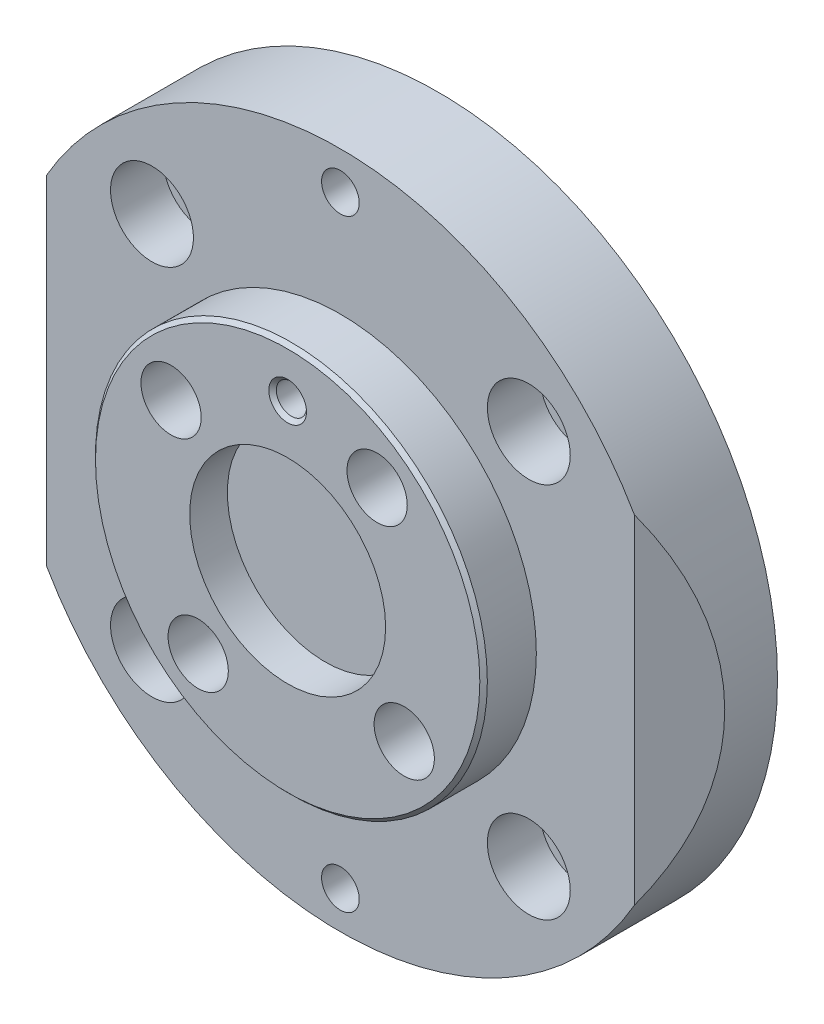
from build123d import *

# Parameters (mm, degrees)
ESQUISSE1_R                                        = 45
BOSS_EXTRU_1_DEPTH                                 = 20
ESQUISSE2_OUTSIDE_W                                = 117.768
ESQUISSE2_OUTSIDE_H                                = 117.768
ESQUISSE2_OUTSIDE_R                                = 26
ENL_V_MAT_EXTRU_1_DEPTH                            = 7
CHANFREIN1_SIZE                                    = 0.5
ESQUISSE3_R                                        = 13
ENL_V_MAT_EXTRU_2_DEPTH                            = 5
TROU_TARAUD_M51_D                                  = 4.2
ESQUISSE7_R                                        = 4
ENL_V_MAT_EXTRU_3_DEPTH                            = 6
DIAM_TRE_DU_PER_AGE_4_0_4_1_D                      = 4
DIAM_TRE_DU_PER_AGE_4_0_4_1_DEPTH                  = 10
DIAM_TRE_DU_PER_AGE_4_0_4_1_TIP                    = 1.201721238
ESQUISSE13_R                                       = 7
ENL_V_MAT_EXTRU_4_DEPTH                            = 5.5
ESQUISSE15_R                                       = 7
ENL_V_MAT_EXTRU_5_DEPTH                            = 5.5
CHAMBRAGE_POUR_VIS_T_TE_HEXAGONALE_M62_D           = 6.4
CHAMBRAGE_POUR_VIS_T_TE_HEXAGONALE_M62_CBORE_D     = 11
CHAMBRAGE_POUR_VIS_T_TE_HEXAGONALE_M62_CBORE_DEPTH = 7
TROU_TARAUD_M61_D                                  = 5
ENL_V_MAT_EXTRU_6_DEPTH                            = 25
ENL_V_MAT_EXTRU_6_DEPTH_BACK                       = 25
CHANFREIN2_SIZE                                    = 0.5
CHANFREIN3_SIZE                                    = 0.5
CHANFREIN4_SIZE                                    = 0.5


with BuildPart() as part:
    # Esquisse1 → Boss.-Extru.1 (new body)
    with BuildSketch(Plane.XY):
        Circle(ESQUISSE1_R)
    extrude(amount=BOSS_EXTRU_1_DEPTH)

    # Esquisse2 outside → Enl_v. mat.-Extru.1 (cut)
    with BuildSketch(Plane.XY.offset(20)):
        Rectangle(ESQUISSE2_OUTSIDE_W, ESQUISSE2_OUTSIDE_H)
        Circle(ESQUISSE2_OUTSIDE_R, mode=Mode.SUBTRACT)
    extrude(amount=-ENL_V_MAT_EXTRU_1_DEPTH, mode=Mode.SUBTRACT)

    # Chanfrein1
    chanfrein1_edges = [part.edges().sort_by_distance(p)[0] for p in [
        (-26, 0, 20),
    ]]
    chamfer(chanfrein1_edges, length=CHANFREIN1_SIZE)

    # Esquisse3 → Enl_v. mat.-Extru.2 (cut)
    with BuildSketch(Plane.XY.offset(20)):
        Circle(ESQUISSE3_R)
    extrude(amount=-ENL_V_MAT_EXTRU_2_DEPTH, mode=Mode.SUBTRACT)

    # Trou taraud_ M51 (through all)
    with Locations(Plane.XY.offset(20)):
        with Locations((-15.470390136, 11.870847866), (11.870847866, 15.470390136), (15.470390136, -11.870847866), (-11.870847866, -15.470390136)):
            Hole(TROU_TARAUD_M51_D / 2)

    # Esquisse7 → Enl_v. mat.-Extru.3 (cut)
    with BuildSketch(Plane.XY.offset(20)):
        with Locations((-15.470390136, 11.870847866)):
            Circle(ESQUISSE7_R)
        with Locations((11.870847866, 15.470390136)):
            Circle(ESQUISSE7_R)
        with Locations((15.470390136, -11.870847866)):
            Circle(ESQUISSE7_R)
        with Locations((-11.870847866, -15.470390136)):
            Circle(ESQUISSE7_R)
    extrude(amount=-ENL_V_MAT_EXTRU_3_DEPTH, mode=Mode.SUBTRACT)

    # Diam_tre du per_age _4.0 _4_1
    with Locations(Plane.XY.offset(20)):
        with Locations((0, 19.5)):
            Hole(DIAM_TRE_DU_PER_AGE_4_0_4_1_D / 2, depth=DIAM_TRE_DU_PER_AGE_4_0_4_1_DEPTH)
            with Locations((0, 0, -(DIAM_TRE_DU_PER_AGE_4_0_4_1_DEPTH + DIAM_TRE_DU_PER_AGE_4_0_4_1_TIP / 2))):  # 118° drill point
                Cone(0, DIAM_TRE_DU_PER_AGE_4_0_4_1_D / 2, DIAM_TRE_DU_PER_AGE_4_0_4_1_TIP, mode=Mode.SUBTRACT)

    # Esquisse13 → Enl_v. mat.-Extru.4 (cut)
    with BuildSketch(Plane(origin=(0, 0, 0), x_dir=(-1, 0, 0), z_dir=(0, 0, -1))):
        Circle(ESQUISSE13_R)
    extrude(amount=-ENL_V_MAT_EXTRU_4_DEPTH, mode=Mode.SUBTRACT)

    # Esquisse15 → Enl_v. mat.-Extru.5 (cut)
    with BuildSketch(Plane(origin=(0, 0, 0), x_dir=(-1, 0, 0), z_dir=(0, 0, -1))):
        with Locations((0, 25)):
            Circle(ESQUISSE15_R)
    extrude(amount=-ENL_V_MAT_EXTRU_5_DEPTH, mode=Mode.SUBTRACT)

    # Chambrage pour vis _ t_te hexagonale M62 (through all)
    with Locations(Plane.XY.offset(13)):
        with Locations((-25, 25), (25, 25), (25, -25), (-25, -25)):
            CounterBoreHole(CHAMBRAGE_POUR_VIS_T_TE_HEXAGONALE_M62_D / 2, CHAMBRAGE_POUR_VIS_T_TE_HEXAGONALE_M62_CBORE_D / 2, CHAMBRAGE_POUR_VIS_T_TE_HEXAGONALE_M62_CBORE_DEPTH)

    # Trou taraud_ M61 (through all)
    with Locations(Plane.XY.offset(13)):
        with Locations((0, 40), (0, -40)):
            Hole(TROU_TARAUD_M61_D / 2)

    # Esquisse23 → Enl_v. mat.-Extru.6 (cut, two sides: drawn at the far end of the back side and taken through both)
    with BuildSketch(Plane(origin=(0, 0, 0), x_dir=(1, 0, 0), z_dir=(0, 1, 0)).offset(-ENL_V_MAT_EXTRU_6_DEPTH_BACK)):
        Polygon((-39, -13), (-45, -13), (-45, -7), align=None)
        Polygon((39, -13), (45, -13), (45, -7), align=None)
    extrude(amount=ENL_V_MAT_EXTRU_6_DEPTH + ENL_V_MAT_EXTRU_6_DEPTH_BACK, mode=Mode.SUBTRACT)

    # Chanfrein2
    chanfrein2_edges = [part.edges().sort_by_distance(p)[0] for p in [
        (7, 25, 0),
    ]]
    chamfer(chanfrein2_edges, length=CHANFREIN2_SIZE)

    # Chanfrein3
    chanfrein3_edges = [part.edges().sort_by_distance(p)[0] for p in [
        (7, 0, 0),
    ]]
    chamfer(chanfrein3_edges, length=CHANFREIN3_SIZE)

    # Chanfrein4
    chanfrein4_edges = [part.edges().sort_by_distance(p)[0] for p in [
        (2, 19.5, 20),
    ]]
    chamfer(chanfrein4_edges, length=CHANFREIN4_SIZE)


solid = part.part
